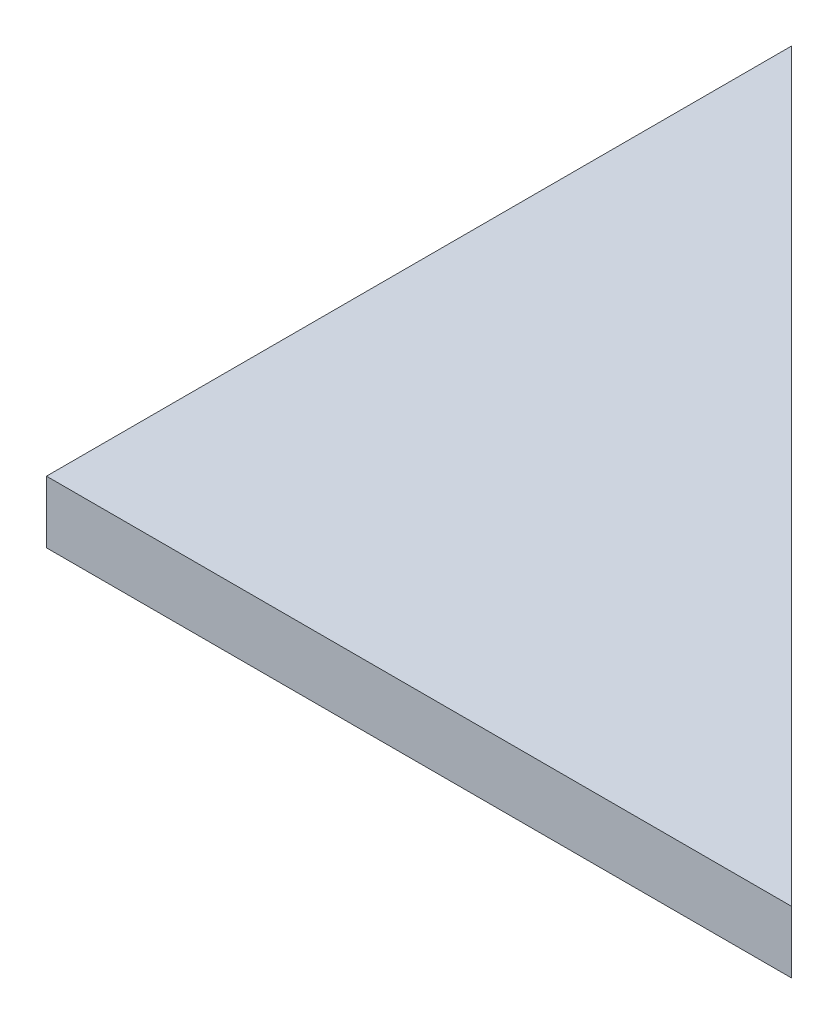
from build123d import *

# Parameters (mm, degrees)
EXTRUDE1_DEPTH = 3.175


with BuildPart() as part:
    # Sketch1 → Extrude1 (new, symmetric)
    with BuildSketch(Plane(origin=(0, 0, 0), x_dir=(1, 0, 0), z_dir=(0, 1, 0))):
        Polygon((0, 0), (0, 76.2), (76.2, 0), align=None)
    extrude(amount=EXTRUDE1_DEPTH, both=True)


solid = part.part
